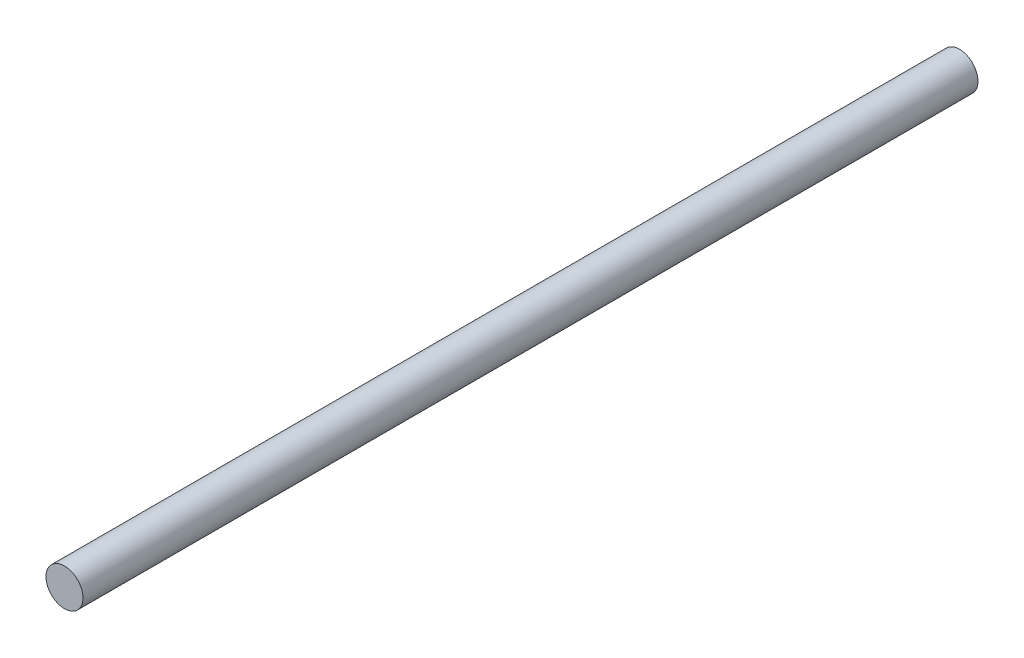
ISO-10303-21;
HEADER;
FILE_DESCRIPTION(('STEP AP214'),'2;1');
FILE_NAME('part.step','',(''),(''),'','','');
FILE_SCHEMA(('AUTOMOTIVE_DESIGN { 1 0 10303 214 1 1 1 1 }'));
ENDSEC;
DATA;
#1=APPLICATION_CONTEXT('core data for automotive mechanical design processes');
#2=APPLICATION_PROTOCOL_DEFINITION('international standard','automotive_design',2000,#1);
#3=PRODUCT_CONTEXT('',#1,'mechanical');
#4=PRODUCT('Part','Part','',(#3));
#5=PRODUCT_RELATED_PRODUCT_CATEGORY('part','',(#4));
#6=PRODUCT_DEFINITION_FORMATION('','',#4);
#7=PRODUCT_DEFINITION_CONTEXT('part definition',#1,'design');
#8=PRODUCT_DEFINITION('design','',#6,#7);
#9=PRODUCT_DEFINITION_SHAPE('','',#8);
#10=(LENGTH_UNIT() NAMED_UNIT(*) SI_UNIT(.MILLI.,.METRE.));
#11=(NAMED_UNIT(*) PLANE_ANGLE_UNIT() SI_UNIT($,.RADIAN.));
#12=(NAMED_UNIT(*) SI_UNIT($,.STERADIAN.) SOLID_ANGLE_UNIT());
#13=UNCERTAINTY_MEASURE_WITH_UNIT(LENGTH_MEASURE(1.E-05),#10,'distance_accuracy_value','');
#14=(GEOMETRIC_REPRESENTATION_CONTEXT(3) GLOBAL_UNCERTAINTY_ASSIGNED_CONTEXT((#13)) GLOBAL_UNIT_ASSIGNED_CONTEXT((#10,
#11,#12)) REPRESENTATION_CONTEXT('',''));
#15=CARTESIAN_POINT('',(0.,0.,0.));
#16=DIRECTION('',(0.,0.,1.));
#17=DIRECTION('',(1.,0.,0.));
#18=AXIS2_PLACEMENT_3D('',#15,#16,#17);
#19=CARTESIAN_POINT('',(0.,0.,-1450.));
#20=DIRECTION('',(0.,0.,1.));
#21=DIRECTION('',(1.,0.,0.));
#22=AXIS2_PLACEMENT_3D('',#19,#20,#21);
#23=CYLINDRICAL_SURFACE('',#22,30.);
#24=CARTESIAN_POINT('',(0.,0.,-1450.));
#25=DIRECTION('',(0.,0.,1.));
#26=DIRECTION('',(1.,0.,0.));
#27=AXIS2_PLACEMENT_3D('',#24,#25,#26);
#28=CIRCLE('',#27,30.);
#29=CARTESIAN_POINT('',(30.,0.,-1450.));
#30=VERTEX_POINT('',#29);
#31=EDGE_CURVE('E10',#30,#30,#28,.T.);
#32=ORIENTED_EDGE('',*,*,#31,.T.);
#33=EDGE_LOOP('',(#32));
#34=FACE_BOUND('',#33,.T.);
#35=CARTESIAN_POINT('',(0.,0.,0.));
#36=DIRECTION('',(0.,0.,1.));
#37=DIRECTION('',(1.,0.,0.));
#38=AXIS2_PLACEMENT_3D('',#35,#36,#37);
#39=CIRCLE('',#38,30.);
#40=CARTESIAN_POINT('',(30.,0.,0.));
#41=VERTEX_POINT('',#40);
#42=EDGE_CURVE('E40',#41,#41,#39,.T.);
#43=ORIENTED_EDGE('',*,*,#42,.F.);
#44=EDGE_LOOP('',(#43));
#45=FACE_BOUND('',#44,.T.);
#46=ADVANCED_FACE('F37',(#34,#45),#23,.T.);
#47=CARTESIAN_POINT('',(0.,0.,-1450.));
#48=DIRECTION('',(0.,0.,1.));
#49=DIRECTION('',(1.,0.,0.));
#50=AXIS2_PLACEMENT_3D('',#47,#48,#49);
#51=PLANE('',#50);
#52=ORIENTED_EDGE('',*,*,#31,.F.);
#53=EDGE_LOOP('',(#52));
#54=FACE_BOUND('',#53,.T.);
#55=ADVANCED_FACE('F54',(#54),#51,.F.);
#56=CARTESIAN_POINT('',(0.,0.,0.));
#57=DIRECTION('',(0.,0.,1.));
#58=DIRECTION('',(1.,0.,0.));
#59=AXIS2_PLACEMENT_3D('',#56,#57,#58);
#60=PLANE('',#59);
#61=ORIENTED_EDGE('',*,*,#42,.T.);
#62=EDGE_LOOP('',(#61));
#63=FACE_BOUND('',#62,.T.);
#64=ADVANCED_FACE('F51',(#63),#60,.T.);
#65=CLOSED_SHELL('',(#46,#55,#64));
#66=MANIFOLD_SOLID_BREP('B2',#65);
#67=ADVANCED_BREP_SHAPE_REPRESENTATION('',(#18,#66),#14);
#68=SHAPE_DEFINITION_REPRESENTATION(#9,#67);
ENDSEC;
END-ISO-10303-21;
